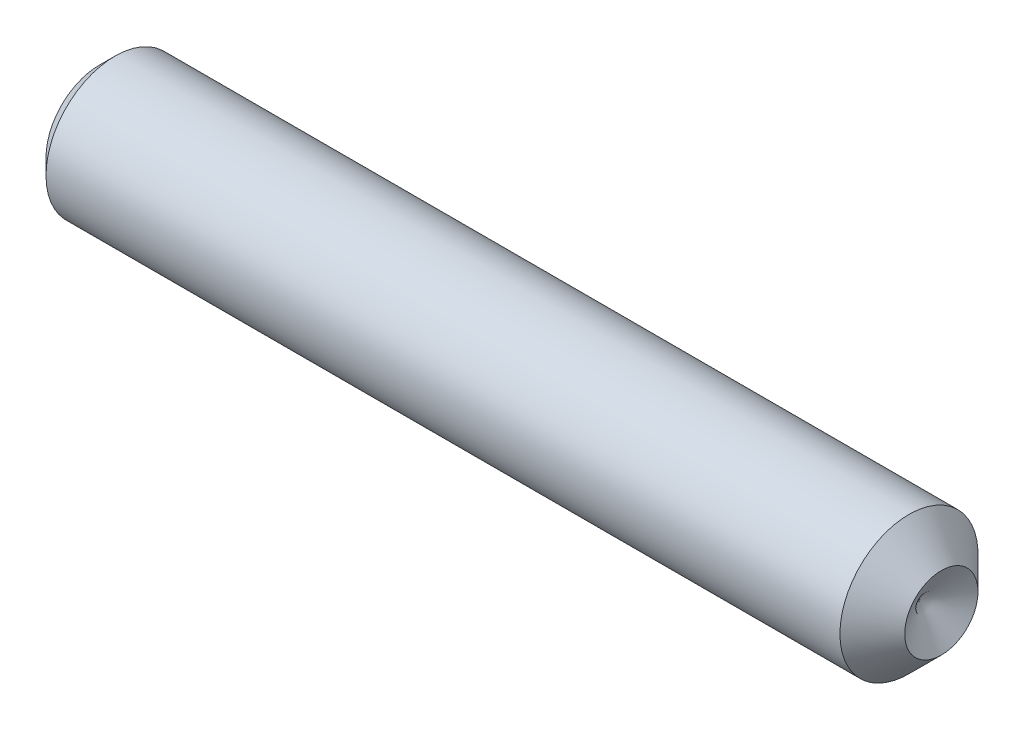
from build123d import *

# Parameters (mm, degrees)
HEX_2_DEPTH = 2.286


with BuildPart() as part:
    # BodySke → BaseBody (revolve)
    with BuildSketch(Plane.XY, mode=Mode.PRIVATE) as basebody_sk:
        Polygon((0, 0), (0, 1.61036), (0.47244, 2.0828), (24.4221, 2.0828), (25.4, 1.1049), (24.736109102, 0), align=None)
    revolve(basebody_sk.sketch.rotate(Axis((-12.7, 0, 0), (1, 0, 0)), 90), axis=Axis((-12.7, 0, 0), (1, 0, 0)))

    # Sketch2 → Hex 2 (cut)
    with BuildSketch(Plane.ZY):
        Polygon((0.571923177, 0.9906), (-0.571923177, 0.9906), (-1.143846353, 0), (-0.571923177, -0.9906), (0.571923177, -0.9906), (1.143846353, 0), align=None)
    extrude(amount=-HEX_2_DEPTH, mode=Mode.SUBTRACT)


solid = part.part
